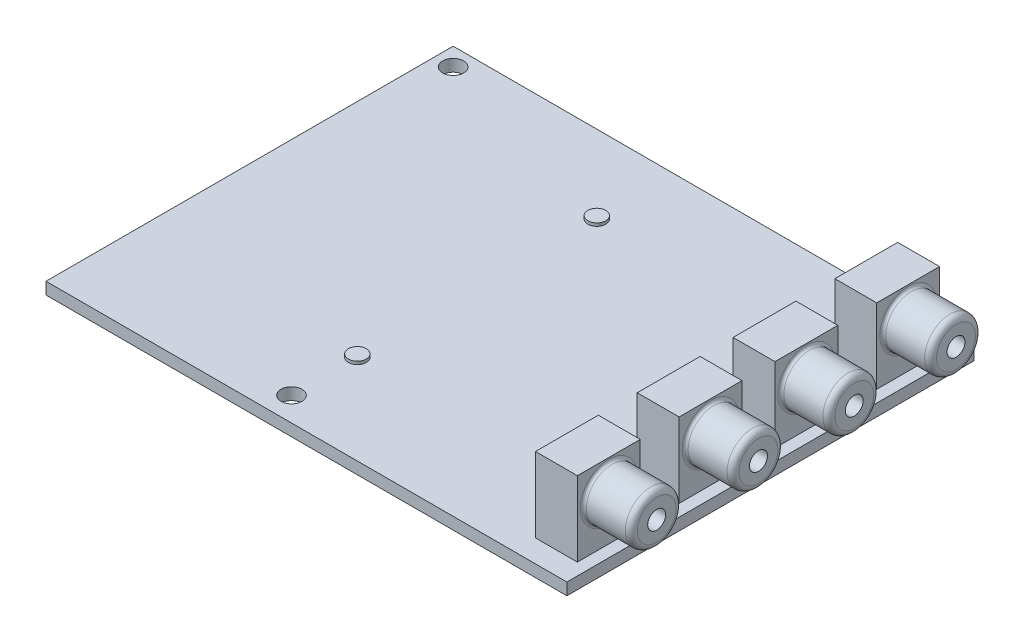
from build123d import *

# Parameters (mm, degrees)
SKETCH_1_W      = 87
SKETCH_1_H      = 68
SKETCH_1_R      = 1.75
EXTRUDE_1_DEPTH = 2
SKETCH_2_W      = 7
SKETCH_2_H      = 10.5
EXTRUDE_2_DEPTH = 12.5
SKETCH_3_R      = 4.25
SKETCH_3_R_2    = 1.5
EXTRUDE_3_DEPTH = 8
FILLET_1_R      = 1
FILLET_2_R      = 0.5
SKETCH_4_R      = 1.5
EXTRUDE_4_DEPTH = 0.5


with BuildPart() as part:
    # Sketch 1 → Extrude 1 (new body)
    with BuildSketch(Plane(origin=(0, 0, 0), x_dir=(1, 0, 0), z_dir=(0, 1, 0))):
        with Locations((43.5, 34)):
            Rectangle(SKETCH_1_W, SKETCH_1_H)
        with Locations(Location((3, 65, 0), (0, 0, 270))):
            Circle(SKETCH_1_R, mode=Mode.SUBTRACT)
        with Locations(Location((37, 4, 0), (0, 0, 270))):
            Circle(SKETCH_1_R, mode=Mode.SUBTRACT)
        with Locations(Location((73, 51, 0), (0, 0, 270))):
            Circle(SKETCH_1_R, mode=Mode.SUBTRACT)
        with Locations(Location((73, 17, 0), (0, 0, 270))):
            Circle(SKETCH_1_R, mode=Mode.SUBTRACT)
    extrude(amount=EXTRUDE_1_DEPTH)

    # Sketch 2 → Extrude 2 (add)
    with BuildSketch(Plane(origin=(0, 2, 0), x_dir=(1, 0, 0), z_dir=(0, 1, 0))):
        with Locations((81.5, 59)):
            Rectangle(SKETCH_2_W, SKETCH_2_H)
        with Locations((81.5, 42)):
            Rectangle(SKETCH_2_W, SKETCH_2_H)
        with Locations((81.5, 26)):
            Rectangle(SKETCH_2_W, SKETCH_2_H)
        with Locations((81.5, 9)):
            Rectangle(SKETCH_2_W, SKETCH_2_H)
    extrude(amount=EXTRUDE_2_DEPTH)

    # Sketch 3 → Extrude 3 (add)
    # profile 1 of 4: a face of its own
    with BuildSketch(Plane(origin=(85, 0, 0), x_dir=(0, 0, -1), z_dir=(1, 0, 0))):
        with Locations(Location((9, 9.5, 0), (0, 0, 180))):
            Circle(SKETCH_3_R)
        with Locations((9, 9.5)):
            Circle(SKETCH_3_R_2, mode=Mode.SUBTRACT)
    # profile 2 of 4: a face of its own
    with BuildSketch(Plane(origin=(85, 0, 0), x_dir=(0, 0, -1), z_dir=(1, 0, 0))):
        with Locations(Location((26, 9.5, 0), (0, 0, 180))):
            Circle(SKETCH_3_R)
        with Locations((26, 9.5)):
            Circle(SKETCH_3_R_2, mode=Mode.SUBTRACT)
    # profile 3 of 4: a face of its own
    with BuildSketch(Plane(origin=(85, 0, 0), x_dir=(0, 0, -1), z_dir=(1, 0, 0))):
        with Locations(Location((42, 9.5, 0), (0, 0, 180))):
            Circle(SKETCH_3_R)
        with Locations((42, 9.5)):
            Circle(SKETCH_3_R_2, mode=Mode.SUBTRACT)
    # profile 4 of 4: a face of its own
    with BuildSketch(Plane(origin=(85, 0, 0), x_dir=(0, 0, -1), z_dir=(1, 0, 0))):
        with Locations(Location((59, 9.5, 0), (0, 0, 180))):
            Circle(SKETCH_3_R)
        with Locations((59, 9.5)):
            Circle(SKETCH_3_R_2, mode=Mode.SUBTRACT)
    extrude(amount=EXTRUDE_3_DEPTH)

    # Fillet 1
    fillet_1_edges = [part.edges().sort_by_distance(p)[0] for p in [
        (93, 9.5, -63.25),
        (93, 9.5, -13.25),
        (93, 9.5, -30.25),
        (93, 9.5, -46.25),
    ]]
    fillet(fillet_1_edges, radius=FILLET_1_R)

    # Fillet 2
    fillet_2_edges = [part.edges().sort_by_distance(p)[0] for p in [
        (85, 9.5, -63.25),
        (85, 9.5, -13.25),
        (85, 9.5, -30.25),
        (85, 9.5, -46.25),
    ]]
    fillet(fillet_2_edges, radius=FILLET_2_R)

    # Sketch 4 → Extrude 4 (add)
    with BuildSketch(Plane(origin=(0, 2, 0), x_dir=(1, 0, 0), z_dir=(0, 1, 0))):
        with Locations(Location((37, 55, 0), (0, 0, 90))):
            Circle(SKETCH_4_R)
        with Locations(Location((37, 15, 0), (0, 0, 90))):
            Circle(SKETCH_4_R)
    extrude(amount=EXTRUDE_4_DEPTH)


solid = part.part
